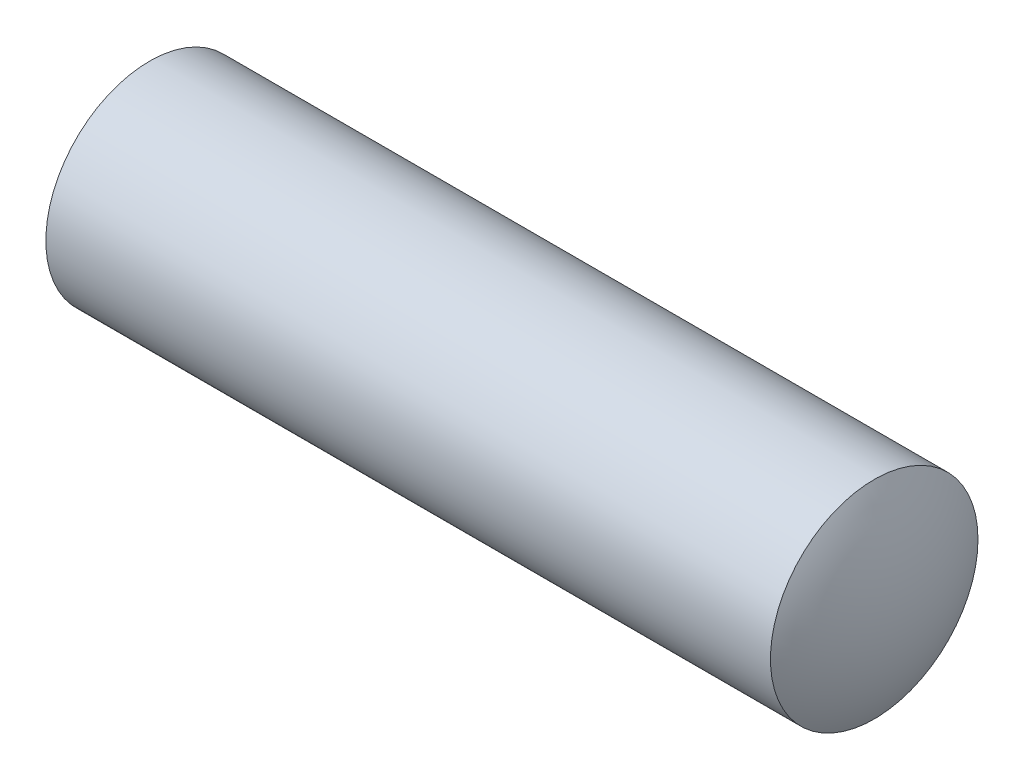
ISO-10303-21;
HEADER;
FILE_DESCRIPTION(('STEP AP214'),'2;1');
FILE_NAME('part.step','',(''),(''),'','','');
FILE_SCHEMA(('AUTOMOTIVE_DESIGN { 1 0 10303 214 1 1 1 1 }'));
ENDSEC;
DATA;
#1=APPLICATION_CONTEXT('core data for automotive mechanical design processes');
#2=APPLICATION_PROTOCOL_DEFINITION('international standard','automotive_design',2000,#1);
#3=PRODUCT_CONTEXT('',#1,'mechanical');
#4=PRODUCT('Part','Part','',(#3));
#5=PRODUCT_RELATED_PRODUCT_CATEGORY('part','',(#4));
#6=PRODUCT_DEFINITION_FORMATION('','',#4);
#7=PRODUCT_DEFINITION_CONTEXT('part definition',#1,'design');
#8=PRODUCT_DEFINITION('design','',#6,#7);
#9=PRODUCT_DEFINITION_SHAPE('','',#8);
#10=(LENGTH_UNIT() NAMED_UNIT(*) SI_UNIT(.MILLI.,.METRE.));
#11=(NAMED_UNIT(*) PLANE_ANGLE_UNIT() SI_UNIT($,.RADIAN.));
#12=(NAMED_UNIT(*) SI_UNIT($,.STERADIAN.) SOLID_ANGLE_UNIT());
#13=UNCERTAINTY_MEASURE_WITH_UNIT(LENGTH_MEASURE(1.E-05),#10,'distance_accuracy_value','');
#14=(GEOMETRIC_REPRESENTATION_CONTEXT(3) GLOBAL_UNCERTAINTY_ASSIGNED_CONTEXT((#13)) GLOBAL_UNIT_ASSIGNED_CONTEXT((#10,
#11,#12)) REPRESENTATION_CONTEXT('',''));
#15=CARTESIAN_POINT('',(0.,0.,0.));
#16=DIRECTION('',(0.,0.,1.));
#17=DIRECTION('',(1.,0.,0.));
#18=AXIS2_PLACEMENT_3D('',#15,#16,#17);
#19=CARTESIAN_POINT('',(10.5,0.,0.));
#20=DIRECTION('',(1.,0.,0.));
#21=DIRECTION('',(0.,1.,0.));
#22=AXIS2_PLACEMENT_3D('',#19,#20,#21);
#23=SPHERICAL_SURFACE('',#22,4.);
#24=CARTESIAN_POINT('',(14.5,0.,0.));
#25=CARTESIAN_POINT('',(14.5000002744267,0.,-0.0436332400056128));
#26=CARTESIAN_POINT('',(14.4992860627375,0.,-0.087266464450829));
#27=CARTESIAN_POINT('',(14.4964306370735,-1.63995471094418E-13,-0.174486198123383));
#28=CARTESIAN_POINT('',(14.4942894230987,-2.04961405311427E-13,-0.21807270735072));
#29=CARTESIAN_POINT('',(14.4885819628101,-2.86805489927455E-13,-0.30515232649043));
#30=CARTESIAN_POINT('',(14.4850157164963,-3.27683640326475E-13,-0.348645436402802));
#31=CARTESIAN_POINT('',(14.4764620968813,-4.09308386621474E-13,-0.43549168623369));
#32=CARTESIAN_POINT('',(14.4714747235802,-4.50054982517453E-13,-0.478844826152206));
#33=CARTESIAN_POINT('',(14.4600841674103,-5.3137298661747E-13,-0.565364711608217));
#34=CARTESIAN_POINT('',(14.4536809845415,-5.71944394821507E-13,-0.608531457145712));
#35=CARTESIAN_POINT('',(14.4394656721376,-6.52868578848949E-13,-0.69463233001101));
#36=CARTESIAN_POINT('',(14.4316535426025,-6.93221354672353E-13,-0.737566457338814));
#37=CARTESIAN_POINT('',(14.4146287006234,-7.73665063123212E-13,-0.823156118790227));
#38=CARTESIAN_POINT('',(14.4054159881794,-8.13755995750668E-13,-0.865811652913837));
#39=CARTESIAN_POINT('',(14.3855998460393,-8.93633087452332E-13,-0.950798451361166));
#40=CARTESIAN_POINT('',(14.3749964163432,-9.3341924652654E-13,-0.993129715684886));
#41=CARTESIAN_POINT('',(14.3524101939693,-1.01264418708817E-12,-1.0774226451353));
#42=CARTESIAN_POINT('',(14.3404274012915,-1.05208296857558E-12,-1.11938431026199));
#43=CARTESIAN_POINT('',(14.3150952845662,-1.13057092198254E-12,-1.20289310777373));
#44=CARTESIAN_POINT('',(14.3017459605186,-1.16962009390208E-12,-1.24444024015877));
#45=CARTESIAN_POINT('',(14.2736950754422,-1.24728701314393E-12,-1.32707548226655));
#46=CARTESIAN_POINT('',(14.2589935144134,-1.28590476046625E-12,-1.36816359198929));
#47=CARTESIAN_POINT('',(14.2282538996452,-1.36266747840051E-12,-1.44983679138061));
#48=CARTESIAN_POINT('',(14.212215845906,-1.40081244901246E-12,-1.49042188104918));
#49=CARTESIAN_POINT('',(14.1788204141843,-1.47658876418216E-12,-1.57104557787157));
#50=CARTESIAN_POINT('',(14.161463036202,-1.51422010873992E-12,-1.61108418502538));
#51=CARTESIAN_POINT('',(14.1254475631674,-1.58892888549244E-12,-1.69057205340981));
#52=CARTESIAN_POINT('',(14.1067894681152,-1.62600631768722E-12,-1.73002131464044));
#53=CARTESIAN_POINT('',(14.0681924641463,-1.69956752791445E-12,-1.8082882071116));
#54=CARTESIAN_POINT('',(14.0482535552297,-1.7360513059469E-12,-1.84710583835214));
#55=CARTESIAN_POINT('',(14.0071165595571,-1.80838628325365E-12,-1.92406805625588));
#56=CARTESIAN_POINT('',(13.9859184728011,-1.84423748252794E-12,-1.96221264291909));
#57=CARTESIAN_POINT('',(13.9641016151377,-1.87975293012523E-12,-2.00000000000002));
#58=B_SPLINE_CURVE_WITH_KNOTS('',3,(#24,#25,#26,#27,#28,#29,#30,#31,#32,#33,#34,#35,#36,#37,#38,
#39,#40,#41,#42,#43,#44,#45,#46,#47,#48,#49,#50,#51,#52,#53,#54,#55,#56,#57),.UNSPECIFIED.,.F.,
.F.,(4,2,2,2,2,2,2,2,2,2,2,2,2,2,2,2,4),(0.,0.130893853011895,0.261787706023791,
0.392681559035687,0.523575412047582,0.654469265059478,0.785363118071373,0.916256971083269,
1.04715082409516,1.17804467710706,1.30893853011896,1.43983238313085,1.57072623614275,
1.70162008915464,1.83251394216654,1.96340779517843,2.09430164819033),.UNSPECIFIED.);
#59=CARTESIAN_POINT('',(14.5,0.,0.));
#60=VERTEX_POINT('',#59);
#61=CARTESIAN_POINT('',(13.9641016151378,-9.36537214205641E-13,-2.));
#62=VERTEX_POINT('',#61);
#63=EDGE_CURVE('E24',#60,#62,#58,.T.);
#64=ORIENTED_EDGE('',*,*,#63,.T.);
#65=CARTESIAN_POINT('',(13.9641016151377,0.,0.));
#66=DIRECTION('',(1.,0.,0.));
#67=DIRECTION('',(0.,0.,-1.));
#68=AXIS2_PLACEMENT_3D('',#65,#66,#67);
#69=CIRCLE('',#68,2.);
#70=EDGE_CURVE('E9',#62,#62,#69,.F.);
#71=ORIENTED_EDGE('',*,*,#70,.F.);
#72=ORIENTED_EDGE('',*,*,#63,.F.);
#73=EDGE_LOOP('',(#64,#71,#72));
#74=FACE_BOUND('',#73,.T.);
#75=ADVANCED_FACE('F14',(#74),#23,.T.);
#76=CARTESIAN_POINT('',(9.93205080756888,0.,0.));
#77=DIRECTION('',(1.,0.,0.));
#78=DIRECTION('',(0.,0.,-1.));
#79=AXIS2_PLACEMENT_3D('',#76,#77,#78);
#80=CYLINDRICAL_SURFACE('',#79,2.);
#81=ORIENTED_EDGE('',*,*,#70,.T.);
#82=EDGE_LOOP('',(#81));
#83=FACE_BOUND('',#82,.T.);
#84=CARTESIAN_POINT('',(0.,0.,0.));
#85=DIRECTION('',(1.,0.,0.));
#86=DIRECTION('',(0.,0.,-1.));
#87=AXIS2_PLACEMENT_3D('',#84,#85,#86);
#88=CIRCLE('',#87,2.);
#89=CARTESIAN_POINT('',(0.,0.,-2.));
#90=VERTEX_POINT('',#89);
#91=EDGE_CURVE('E33',#90,#90,#88,.T.);
#92=ORIENTED_EDGE('',*,*,#91,.T.);
#93=EDGE_LOOP('',(#92));
#94=FACE_BOUND('',#93,.T.);
#95=ADVANCED_FACE('F16',(#83,#94),#80,.T.);
#96=CARTESIAN_POINT('',(0.,0.,0.));
#97=DIRECTION('',(1.,0.,0.));
#98=DIRECTION('',(0.,0.,-1.));
#99=AXIS2_PLACEMENT_3D('',#96,#97,#98);
#100=PLANE('',#99);
#101=ORIENTED_EDGE('',*,*,#91,.F.);
#102=EDGE_LOOP('',(#101));
#103=FACE_BOUND('',#102,.T.);
#104=ADVANCED_FACE('F47',(#103),#100,.F.);
#105=CLOSED_SHELL('',(#75,#95,#104));
#106=MANIFOLD_SOLID_BREP('B1',#105);
#107=ADVANCED_BREP_SHAPE_REPRESENTATION('',(#18,#106),#14);
#108=SHAPE_DEFINITION_REPRESENTATION(#9,#107);
ENDSEC;
END-ISO-10303-21;
